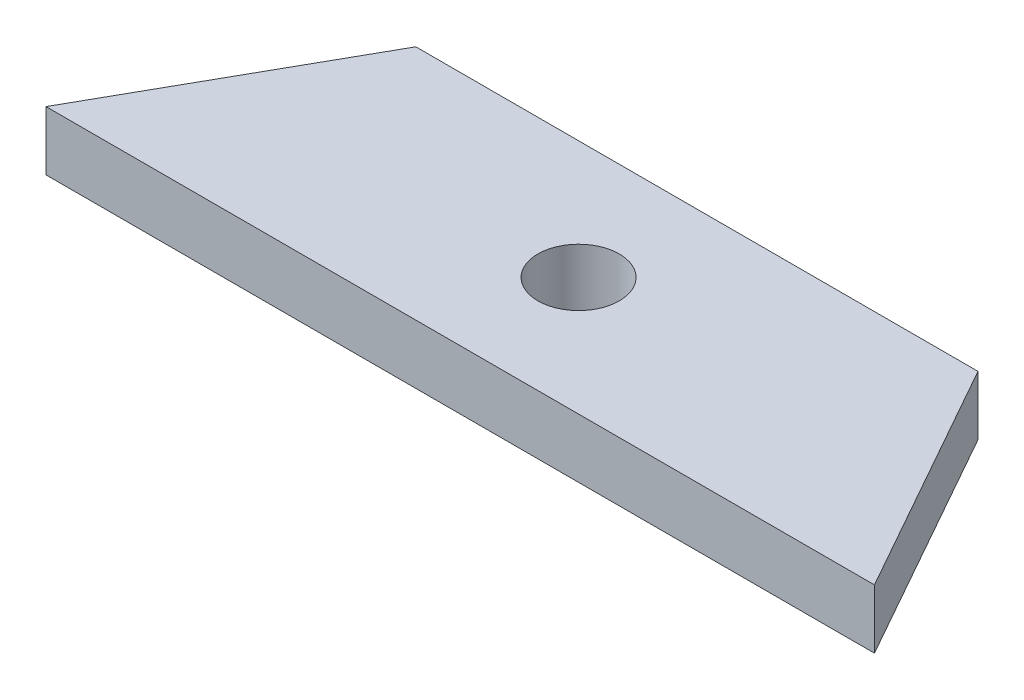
ISO-10303-21;
HEADER;
FILE_DESCRIPTION(('STEP AP214'),'2;1');
FILE_NAME('part.step','',(''),(''),'','','');
FILE_SCHEMA(('AUTOMOTIVE_DESIGN { 1 0 10303 214 1 1 1 1 }'));
ENDSEC;
DATA;
#1=APPLICATION_CONTEXT('core data for automotive mechanical design processes');
#2=APPLICATION_PROTOCOL_DEFINITION('international standard','automotive_design',2000,#1);
#3=PRODUCT_CONTEXT('',#1,'mechanical');
#4=PRODUCT('Part','Part','',(#3));
#5=PRODUCT_RELATED_PRODUCT_CATEGORY('part','',(#4));
#6=PRODUCT_DEFINITION_FORMATION('','',#4);
#7=PRODUCT_DEFINITION_CONTEXT('part definition',#1,'design');
#8=PRODUCT_DEFINITION('design','',#6,#7);
#9=PRODUCT_DEFINITION_SHAPE('','',#8);
#10=(LENGTH_UNIT() NAMED_UNIT(*) SI_UNIT(.MILLI.,.METRE.));
#11=(NAMED_UNIT(*) PLANE_ANGLE_UNIT() SI_UNIT($,.RADIAN.));
#12=(NAMED_UNIT(*) SI_UNIT($,.STERADIAN.) SOLID_ANGLE_UNIT());
#13=UNCERTAINTY_MEASURE_WITH_UNIT(LENGTH_MEASURE(1.E-05),#10,'distance_accuracy_value','');
#14=(GEOMETRIC_REPRESENTATION_CONTEXT(3) GLOBAL_UNCERTAINTY_ASSIGNED_CONTEXT((#13)) GLOBAL_UNIT_ASSIGNED_CONTEXT((#10,
#11,#12)) REPRESENTATION_CONTEXT('',''));
#15=CARTESIAN_POINT('',(0.,0.,0.));
#16=DIRECTION('',(0.,0.,1.));
#17=DIRECTION('',(1.,0.,0.));
#18=AXIS2_PLACEMENT_3D('',#15,#16,#17);
#19=CARTESIAN_POINT('',(0.,4.,0.));
#20=DIRECTION('',(0.,1.,0.));
#21=DIRECTION('',(0.,0.,1.));
#22=AXIS2_PLACEMENT_3D('',#19,#20,#21);
#23=PLANE('',#22);
#24=DIRECTION('',(-0.490261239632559,0.,0.871575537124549));
#25=VECTOR('',#24,1.);
#26=CARTESIAN_POINT('',(8.99999999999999,4.,-16.));
#27=LINE('',#26,#25);
#28=CARTESIAN_POINT('',(8.99999999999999,4.,-16.));
#29=VERTEX_POINT('',#28);
#30=CARTESIAN_POINT('',(0.,4.,0.));
#31=VERTEX_POINT('',#30);
#32=EDGE_CURVE('E82',#29,#31,#27,.T.);
#33=ORIENTED_EDGE('',*,*,#32,.T.);
#34=DIRECTION('',(1.,0.,0.));
#35=VECTOR('',#34,1.);
#36=CARTESIAN_POINT('',(0.,4.,0.));
#37=LINE('',#36,#35);
#38=CARTESIAN_POINT('',(56.,4.,0.));
#39=VERTEX_POINT('',#38);
#40=EDGE_CURVE('E77',#31,#39,#37,.T.);
#41=ORIENTED_EDGE('',*,*,#40,.T.);
#42=DIRECTION('',(-0.490261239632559,0.,-0.871575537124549));
#43=VECTOR('',#42,1.);
#44=CARTESIAN_POINT('',(56.,4.,0.));
#45=LINE('',#44,#43);
#46=CARTESIAN_POINT('',(47.,4.,-16.));
#47=VERTEX_POINT('',#46);
#48=EDGE_CURVE('E80',#39,#47,#45,.T.);
#49=ORIENTED_EDGE('',*,*,#48,.T.);
#50=DIRECTION('',(-1.,0.,0.));
#51=VECTOR('',#50,1.);
#52=CARTESIAN_POINT('',(47.,4.,-16.));
#53=LINE('',#52,#51);
#54=EDGE_CURVE('E47',#47,#29,#53,.T.);
#55=ORIENTED_EDGE('',*,*,#54,.T.);
#56=EDGE_LOOP('',(#33,#41,#49,#55));
#57=FACE_BOUND('',#56,.T.);
#58=CARTESIAN_POINT('',(28.,4.,-8.));
#59=DIRECTION('',(0.,1.,0.));
#60=DIRECTION('',(0.,0.,1.));
#61=AXIS2_PLACEMENT_3D('',#58,#59,#60);
#62=CIRCLE('',#61,2.75);
#63=CARTESIAN_POINT('',(28.,4.,-5.25));
#64=VERTEX_POINT('',#63);
#65=EDGE_CURVE('E97',#64,#64,#62,.T.);
#66=ORIENTED_EDGE('',*,*,#65,.F.);
#67=EDGE_LOOP('',(#66));
#68=FACE_BOUND('',#67,.T.);
#69=ADVANCED_FACE('F30',(#57,#68),#23,.T.);
#70=CARTESIAN_POINT('',(0.,0.,0.));
#71=DIRECTION('',(0.,1.,0.));
#72=DIRECTION('',(0.,0.,1.));
#73=AXIS2_PLACEMENT_3D('',#70,#71,#72);
#74=PLANE('',#73);
#75=DIRECTION('',(-0.490261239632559,0.,0.871575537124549));
#76=VECTOR('',#75,1.);
#77=CARTESIAN_POINT('',(8.99999999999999,0.,-16.));
#78=LINE('',#77,#76);
#79=CARTESIAN_POINT('',(8.99999999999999,0.,-16.));
#80=VERTEX_POINT('',#79);
#81=CARTESIAN_POINT('',(0.,0.,0.));
#82=VERTEX_POINT('',#81);
#83=EDGE_CURVE('E94',#80,#82,#78,.T.);
#84=ORIENTED_EDGE('',*,*,#83,.F.);
#85=DIRECTION('',(-1.,0.,0.));
#86=VECTOR('',#85,1.);
#87=CARTESIAN_POINT('',(47.,0.,-16.));
#88=LINE('',#87,#86);
#89=CARTESIAN_POINT('',(47.,0.,-16.));
#90=VERTEX_POINT('',#89);
#91=EDGE_CURVE('E70',#90,#80,#88,.T.);
#92=ORIENTED_EDGE('',*,*,#91,.F.);
#93=DIRECTION('',(-0.490261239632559,0.,-0.871575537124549));
#94=VECTOR('',#93,1.);
#95=CARTESIAN_POINT('',(56.,0.,0.));
#96=LINE('',#95,#94);
#97=CARTESIAN_POINT('',(56.,0.,0.));
#98=VERTEX_POINT('',#97);
#99=EDGE_CURVE('E64',#98,#90,#96,.T.);
#100=ORIENTED_EDGE('',*,*,#99,.F.);
#101=DIRECTION('',(1.,0.,0.));
#102=VECTOR('',#101,1.);
#103=CARTESIAN_POINT('',(0.,0.,0.));
#104=LINE('',#103,#102);
#105=EDGE_CURVE('E86',#82,#98,#104,.T.);
#106=ORIENTED_EDGE('',*,*,#105,.F.);
#107=EDGE_LOOP('',(#84,#92,#100,#106));
#108=FACE_BOUND('',#107,.T.);
#109=CARTESIAN_POINT('',(28.,0.,-8.));
#110=DIRECTION('',(0.,1.,0.));
#111=DIRECTION('',(0.,0.,1.));
#112=AXIS2_PLACEMENT_3D('',#109,#110,#111);
#113=CIRCLE('',#112,2.75);
#114=CARTESIAN_POINT('',(28.,0.,-5.25));
#115=VERTEX_POINT('',#114);
#116=EDGE_CURVE('E109',#115,#115,#113,.T.);
#117=ORIENTED_EDGE('',*,*,#116,.T.);
#118=EDGE_LOOP('',(#117));
#119=FACE_BOUND('',#118,.T.);
#120=ADVANCED_FACE('F105',(#108,#119),#74,.F.);
#121=CARTESIAN_POINT('',(8.99999999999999,4.,-16.));
#122=DIRECTION('',(0.871575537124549,0.,0.490261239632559));
#123=DIRECTION('',(0.490261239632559,0.,-0.871575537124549));
#124=AXIS2_PLACEMENT_3D('',#121,#122,#123);
#125=PLANE('',#124);
#126=ORIENTED_EDGE('',*,*,#83,.T.);
#127=DIRECTION('',(0.,-1.,0.));
#128=VECTOR('',#127,1.);
#129=CARTESIAN_POINT('',(0.,4.,0.));
#130=LINE('',#129,#128);
#131=EDGE_CURVE('E11',#31,#82,#130,.T.);
#132=ORIENTED_EDGE('',*,*,#131,.F.);
#133=ORIENTED_EDGE('',*,*,#32,.F.);
#134=DIRECTION('',(0.,-1.,0.));
#135=VECTOR('',#134,1.);
#136=CARTESIAN_POINT('',(8.99999999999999,4.,-16.));
#137=LINE('',#136,#135);
#138=EDGE_CURVE('E90',#29,#80,#137,.T.);
#139=ORIENTED_EDGE('',*,*,#138,.T.);
#140=EDGE_LOOP('',(#126,#132,#133,#139));
#141=FACE_BOUND('',#140,.T.);
#142=ADVANCED_FACE('F32',(#141),#125,.F.);
#143=CARTESIAN_POINT('',(0.,4.,0.));
#144=DIRECTION('',(0.,0.,-1.));
#145=DIRECTION('',(-1.,0.,0.));
#146=AXIS2_PLACEMENT_3D('',#143,#144,#145);
#147=PLANE('',#146);
#148=ORIENTED_EDGE('',*,*,#105,.T.);
#149=DIRECTION('',(0.,-1.,0.));
#150=VECTOR('',#149,1.);
#151=CARTESIAN_POINT('',(56.,4.,0.));
#152=LINE('',#151,#150);
#153=EDGE_CURVE('E39',#39,#98,#152,.T.);
#154=ORIENTED_EDGE('',*,*,#153,.F.);
#155=ORIENTED_EDGE('',*,*,#40,.F.);
#156=ORIENTED_EDGE('',*,*,#131,.T.);
#157=EDGE_LOOP('',(#148,#154,#155,#156));
#158=FACE_BOUND('',#157,.T.);
#159=ADVANCED_FACE('F85',(#158),#147,.F.);
#160=CARTESIAN_POINT('',(56.,4.,0.));
#161=DIRECTION('',(-0.871575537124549,0.,0.490261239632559));
#162=DIRECTION('',(0.490261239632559,0.,0.871575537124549));
#163=AXIS2_PLACEMENT_3D('',#160,#161,#162);
#164=PLANE('',#163);
#165=ORIENTED_EDGE('',*,*,#99,.T.);
#166=DIRECTION('',(0.,-1.,0.));
#167=VECTOR('',#166,1.);
#168=CARTESIAN_POINT('',(47.,4.,-16.));
#169=LINE('',#168,#167);
#170=EDGE_CURVE('E87',#47,#90,#169,.T.);
#171=ORIENTED_EDGE('',*,*,#170,.F.);
#172=ORIENTED_EDGE('',*,*,#48,.F.);
#173=ORIENTED_EDGE('',*,*,#153,.T.);
#174=EDGE_LOOP('',(#165,#171,#172,#173));
#175=FACE_BOUND('',#174,.T.);
#176=ADVANCED_FACE('F88',(#175),#164,.F.);
#177=CARTESIAN_POINT('',(47.,4.,-16.));
#178=DIRECTION('',(0.,0.,1.));
#179=DIRECTION('',(1.,0.,0.));
#180=AXIS2_PLACEMENT_3D('',#177,#178,#179);
#181=PLANE('',#180);
#182=ORIENTED_EDGE('',*,*,#91,.T.);
#183=ORIENTED_EDGE('',*,*,#138,.F.);
#184=ORIENTED_EDGE('',*,*,#54,.F.);
#185=ORIENTED_EDGE('',*,*,#170,.T.);
#186=EDGE_LOOP('',(#182,#183,#184,#185));
#187=FACE_BOUND('',#186,.T.);
#188=ADVANCED_FACE('F102',(#187),#181,.F.);
#189=CARTESIAN_POINT('',(28.,4.,-8.));
#190=DIRECTION('',(0.,-1.,0.));
#191=DIRECTION('',(0.,0.,-1.));
#192=AXIS2_PLACEMENT_3D('',#189,#190,#191);
#193=CYLINDRICAL_SURFACE('',#192,2.75);
#194=ORIENTED_EDGE('',*,*,#65,.T.);
#195=EDGE_LOOP('',(#194));
#196=FACE_BOUND('',#195,.T.);
#197=ORIENTED_EDGE('',*,*,#116,.F.);
#198=EDGE_LOOP('',(#197));
#199=FACE_BOUND('',#198,.T.);
#200=ADVANCED_FACE('F115',(#196,#199),#193,.F.);
#201=CLOSED_SHELL('',(#69,#120,#142,#159,#176,#188,#200));
#202=MANIFOLD_SOLID_BREP('B2',#201);
#203=ADVANCED_BREP_SHAPE_REPRESENTATION('',(#18,#202),#14);
#204=SHAPE_DEFINITION_REPRESENTATION(#9,#203);
ENDSEC;
END-ISO-10303-21;
